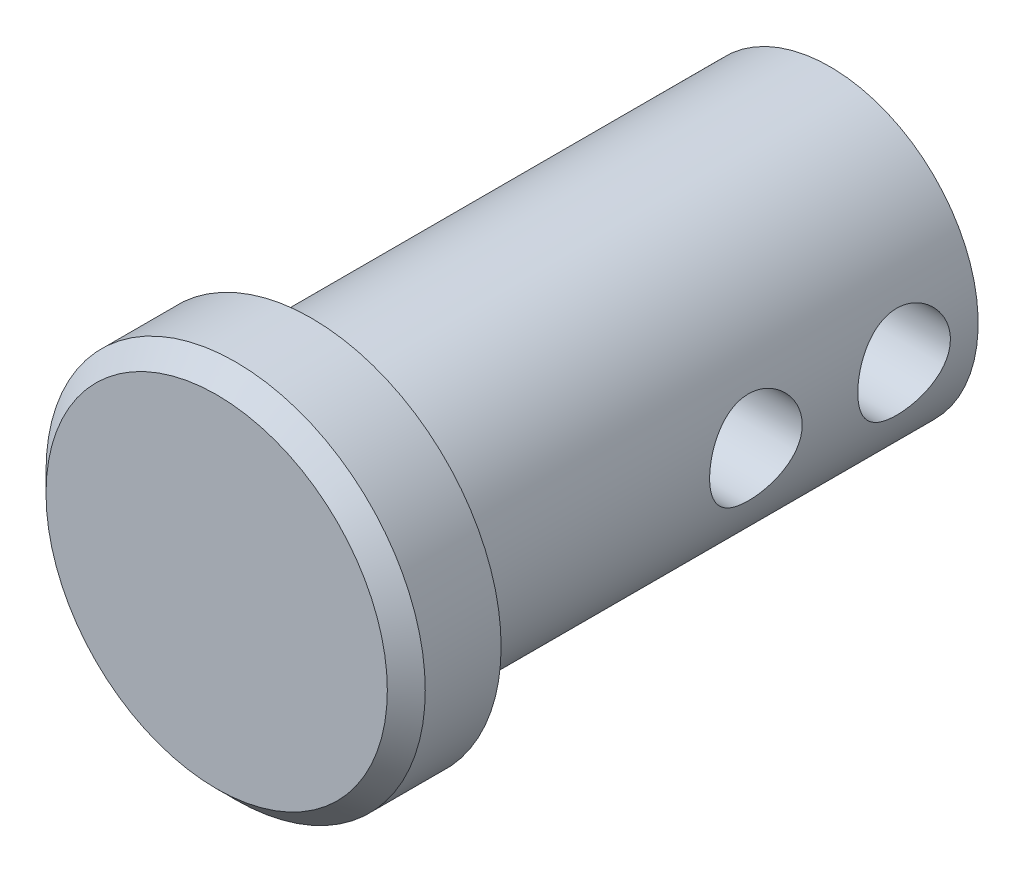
ISO-10303-21;
HEADER;
FILE_DESCRIPTION(('STEP AP214'),'2;1');
FILE_NAME('part.step','',(''),(''),'','','');
FILE_SCHEMA(('AUTOMOTIVE_DESIGN { 1 0 10303 214 1 1 1 1 }'));
ENDSEC;
DATA;
#1=APPLICATION_CONTEXT('core data for automotive mechanical design processes');
#2=APPLICATION_PROTOCOL_DEFINITION('international standard','automotive_design',2000,#1);
#3=PRODUCT_CONTEXT('',#1,'mechanical');
#4=PRODUCT('Part','Part','',(#3));
#5=PRODUCT_RELATED_PRODUCT_CATEGORY('part','',(#4));
#6=PRODUCT_DEFINITION_FORMATION('','',#4);
#7=PRODUCT_DEFINITION_CONTEXT('part definition',#1,'design');
#8=PRODUCT_DEFINITION('design','',#6,#7);
#9=PRODUCT_DEFINITION_SHAPE('','',#8);
#10=(LENGTH_UNIT() NAMED_UNIT(*) SI_UNIT(.MILLI.,.METRE.));
#11=(NAMED_UNIT(*) PLANE_ANGLE_UNIT() SI_UNIT($,.RADIAN.));
#12=(NAMED_UNIT(*) SI_UNIT($,.STERADIAN.) SOLID_ANGLE_UNIT());
#13=UNCERTAINTY_MEASURE_WITH_UNIT(LENGTH_MEASURE(1.E-05),#10,'distance_accuracy_value','');
#14=(GEOMETRIC_REPRESENTATION_CONTEXT(3) GLOBAL_UNCERTAINTY_ASSIGNED_CONTEXT((#13)) GLOBAL_UNIT_ASSIGNED_CONTEXT((#10,
#11,#12)) REPRESENTATION_CONTEXT('',''));
#15=CARTESIAN_POINT('',(0.,0.,0.));
#16=DIRECTION('',(0.,0.,1.));
#17=DIRECTION('',(1.,0.,0.));
#18=AXIS2_PLACEMENT_3D('',#15,#16,#17);
#19=CARTESIAN_POINT('',(0.,0.,25.4));
#20=DIRECTION('',(0.,0.,-1.));
#21=DIRECTION('',(-1.,0.,0.));
#22=AXIS2_PLACEMENT_3D('',#19,#20,#21);
#23=CYLINDRICAL_SURFACE('',#22,6.35);
#24=CARTESIAN_POINT('',(0.,0.,25.4));
#25=DIRECTION('',(0.,0.,1.));
#26=DIRECTION('',(1.,0.,0.));
#27=AXIS2_PLACEMENT_3D('',#24,#25,#26);
#28=CIRCLE('',#27,6.35);
#29=CARTESIAN_POINT('',(6.35,0.,25.4));
#30=VERTEX_POINT('',#29);
#31=EDGE_CURVE('E50',#30,#30,#28,.T.);
#32=ORIENTED_EDGE('',*,*,#31,.F.);
#33=EDGE_LOOP('',(#32));
#34=FACE_BOUND('',#33,.T.);
#35=CARTESIAN_POINT('',(6.35,0.,4.36562500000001));
#36=CARTESIAN_POINT('',(6.34999945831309,-0.108647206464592,4.36562570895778));
#37=CARTESIAN_POINT('',(6.34718528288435,-0.217301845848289,4.37457727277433));
#38=CARTESIAN_POINT('',(6.3362346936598,-0.431433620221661,4.41005315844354));
#39=CARTESIAN_POINT('',(6.32809707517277,-0.536910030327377,4.43658145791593));
#40=CARTESIAN_POINT('',(6.30738857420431,-0.741566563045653,4.50622887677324));
#41=CARTESIAN_POINT('',(6.29482455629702,-0.840756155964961,4.54932231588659));
#42=CARTESIAN_POINT('',(6.26656051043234,-1.030501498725,4.65076749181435));
#43=CARTESIAN_POINT('',(6.25085998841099,-1.12105588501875,4.70912163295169));
#44=CARTESIAN_POINT('',(6.21744714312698,-1.29375746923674,4.84132888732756));
#45=CARTESIAN_POINT('',(6.19969099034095,-1.37560054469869,4.91556815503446));
#46=CARTESIAN_POINT('',(6.16442198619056,-1.52590084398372,5.07661607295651));
#47=CARTESIAN_POINT('',(6.14690918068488,-1.59435557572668,5.1634270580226));
#48=CARTESIAN_POINT('',(6.11363942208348,-1.71758509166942,5.34978699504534));
#49=CARTESIAN_POINT('',(6.09793656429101,-1.77197994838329,5.44959774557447));
#50=CARTESIAN_POINT('',(6.07072385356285,-1.86308588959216,5.65752030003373));
#51=CARTESIAN_POINT('',(6.05921289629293,-1.89980163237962,5.76562990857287));
#52=CARTESIAN_POINT('',(6.04214576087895,-1.95339430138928,5.98364957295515));
#53=CARTESIAN_POINT('',(6.03642069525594,-1.97083537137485,6.09340736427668));
#54=CARTESIAN_POINT('',(6.03107212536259,-1.98714606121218,6.31442907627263));
#55=CARTESIAN_POINT('',(6.03144699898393,-1.98602061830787,6.42569258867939));
#56=CARTESIAN_POINT('',(6.03810687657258,-1.96567146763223,6.64190070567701));
#57=CARTESIAN_POINT('',(6.04415767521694,-1.94716491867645,6.74692123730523));
#58=CARTESIAN_POINT('',(6.06110715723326,-1.89374166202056,6.95228504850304));
#59=CARTESIAN_POINT('',(6.07200635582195,-1.85882321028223,7.05262782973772));
#60=CARTESIAN_POINT('',(6.09760407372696,-1.77306088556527,7.24749621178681));
#61=CARTESIAN_POINT('',(6.11235576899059,-1.72199181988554,7.34191541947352));
#62=CARTESIAN_POINT('',(6.14397197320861,-1.60553432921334,7.52107933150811));
#63=CARTESIAN_POINT('',(6.1608370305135,-1.54014218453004,7.60582151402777));
#64=CARTESIAN_POINT('',(6.19571925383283,-1.39337566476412,7.76728022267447));
#65=CARTESIAN_POINT('',(6.21375391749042,-1.31140925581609,7.84345579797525));
#66=CARTESIAN_POINT('',(6.24826618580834,-1.13564099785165,7.98111163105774));
#67=CARTESIAN_POINT('',(6.26474367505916,-1.04183827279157,8.04259080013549));
#68=CARTESIAN_POINT('',(6.29445805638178,-0.844017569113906,8.14947520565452));
#69=CARTESIAN_POINT('',(6.3076686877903,-0.739925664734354,8.19475141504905));
#70=CARTESIAN_POINT('',(6.3291712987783,-0.525094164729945,8.26699038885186));
#71=CARTESIAN_POINT('',(6.33746477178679,-0.414356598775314,8.29395871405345));
#72=CARTESIAN_POINT('',(6.34795830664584,-0.193968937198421,8.32789489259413));
#73=CARTESIAN_POINT('',(6.35038136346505,-0.0844420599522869,8.33559506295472));
#74=CARTESIAN_POINT('',(6.34952057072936,0.134350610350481,8.33284111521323));
#75=CARTESIAN_POINT('',(6.34623755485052,0.243616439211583,8.32238964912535));
#76=CARTESIAN_POINT('',(6.33448002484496,0.455960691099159,8.28421699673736));
#77=CARTESIAN_POINT('',(6.32613659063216,0.559125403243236,8.25693156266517));
#78=CARTESIAN_POINT('',(6.30523442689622,0.759383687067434,8.18639721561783));
#79=CARTESIAN_POINT('',(6.29267517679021,0.856476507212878,8.14314633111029));
#80=CARTESIAN_POINT('',(6.26425186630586,1.0444676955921,8.04073001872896));
#81=CARTESIAN_POINT('',(6.24831470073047,1.13515733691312,7.98120230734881));
#82=CARTESIAN_POINT('',(6.21495788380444,1.30550578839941,7.84835677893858));
#83=CARTESIAN_POINT('',(6.19753783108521,1.38516159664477,7.77503522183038));
#84=CARTESIAN_POINT('',(6.16230979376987,1.53445759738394,7.61323901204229));
#85=CARTESIAN_POINT('',(6.14451378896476,1.60357585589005,7.52427904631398));
#86=CARTESIAN_POINT('',(6.11127091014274,1.72594984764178,7.33563649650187));
#87=CARTESIAN_POINT('',(6.09582399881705,1.77920583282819,7.23595408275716));
#88=CARTESIAN_POINT('',(6.06919954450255,1.8680125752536,7.02890203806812));
#89=CARTESIAN_POINT('',(6.05800551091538,1.90363188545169,6.92156405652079));
#90=CARTESIAN_POINT('',(6.04124983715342,1.95616344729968,6.70199241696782));
#91=CARTESIAN_POINT('',(6.03568605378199,1.97308281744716,6.58976063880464));
#92=CARTESIAN_POINT('',(6.03104414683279,1.98722307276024,6.36904351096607));
#93=CARTESIAN_POINT('',(6.03168409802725,1.98530018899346,6.26061826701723));
#94=CARTESIAN_POINT('',(6.03869268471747,1.96387748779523,6.04571659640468));
#95=CARTESIAN_POINT('',(6.04506105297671,1.94437849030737,5.93924007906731));
#96=CARTESIAN_POINT('',(6.06261192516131,1.88893021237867,5.73278946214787));
#97=CARTESIAN_POINT('',(6.07372258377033,1.85322594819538,5.63274298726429));
#98=CARTESIAN_POINT('',(6.0994878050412,1.76657360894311,5.43998084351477));
#99=CARTESIAN_POINT('',(6.11414308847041,1.71562243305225,5.34726667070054));
#100=CARTESIAN_POINT('',(6.14606160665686,1.5975913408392,5.1678745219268));
#101=CARTESIAN_POINT('',(6.16340443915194,1.5299584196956,5.08157459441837));
#102=CARTESIAN_POINT('',(6.19837785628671,1.38145678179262,4.92127170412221));
#103=CARTESIAN_POINT('',(6.21600851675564,1.30058452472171,4.8472720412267));
#104=CARTESIAN_POINT('',(6.25026169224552,1.12472257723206,4.71125147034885));
#105=CARTESIAN_POINT('',(6.26683248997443,1.02935813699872,4.64970060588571));
#106=CARTESIAN_POINT('',(6.29644996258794,0.829118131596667,4.54358547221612));
#107=CARTESIAN_POINT('',(6.30949802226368,0.724246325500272,4.49901452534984));
#108=CARTESIAN_POINT('',(6.32969033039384,0.517124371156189,4.43136120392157));
#109=CARTESIAN_POINT('',(6.3372403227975,0.415401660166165,4.40678114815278));
#110=CARTESIAN_POINT('',(6.34739491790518,0.209121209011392,4.37391435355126));
#111=CARTESIAN_POINT('',(6.35000052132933,0.104564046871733,4.36562431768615));
#112=CARTESIAN_POINT('',(6.35,0.,4.36562500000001));
#113=B_SPLINE_CURVE_WITH_KNOTS('',3,(#35,#36,#37,#38,#39,#40,#41,#42,#43,#44,#45,#46,#47,#48,
#49,#50,#51,#52,#53,#54,#55,#56,#57,#58,#59,#60,#61,#62,#63,#64,#65,#66,#67,#68,#69,#70,#71,#72,
#73,#74,#75,#76,#77,#78,#79,#80,#81,#82,#83,#84,#85,#86,#87,#88,#89,#90,#91,#92,#93,#94,#95,#96,
#97,#98,#99,#100,#101,#102,#103,#104,#105,#106,#107,#108,#109,#110,#111,#112),.UNSPECIFIED.,.T.,
.F.,(4,2,2,2,2,2,2,2,2,2,2,2,2,2,2,2,2,2,2,2,2,2,2,2,2,2,2,2,2,2,2,2,2,2,2,2,2,2,4),(0.,
0.325557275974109,0.651188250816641,0.976316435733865,1.30149587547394,1.63572542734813,
1.9700171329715,2.31257111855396,2.65503479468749,2.98718525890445,3.31924739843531,
3.63818356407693,3.95715362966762,4.28078332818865,4.60449717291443,4.94294711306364,
5.28142211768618,5.62253543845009,5.96354510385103,6.29138265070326,6.61917230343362,
6.93881369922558,7.25849457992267,7.58596915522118,7.91353265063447,8.25407573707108,
8.59461341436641,8.9338168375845,9.27289109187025,9.59663123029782,9.92035626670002,
10.2393418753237,10.5583924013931,10.8899247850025,11.2215459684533,11.5639956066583,
11.9063104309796,12.2196961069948,12.5330183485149),.UNSPECIFIED.);
#114=CARTESIAN_POINT('',(6.35,0.,4.36562500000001));
#115=VERTEX_POINT('',#114);
#116=EDGE_CURVE('E54',#115,#115,#113,.T.);
#117=ORIENTED_EDGE('',*,*,#116,.T.);
#118=EDGE_LOOP('',(#117));
#119=FACE_BOUND('',#118,.T.);
#120=CARTESIAN_POINT('',(-6.35,0.,8.334375));
#121=CARTESIAN_POINT('',(-6.34999945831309,-0.108647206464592,8.33437429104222));
#122=CARTESIAN_POINT('',(-6.34718528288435,-0.217301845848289,8.32542272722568));
#123=CARTESIAN_POINT('',(-6.3362346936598,-0.431433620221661,8.28994684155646));
#124=CARTESIAN_POINT('',(-6.32809707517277,-0.536910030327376,8.26341854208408));
#125=CARTESIAN_POINT('',(-6.30738857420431,-0.741566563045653,8.19377112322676));
#126=CARTESIAN_POINT('',(-6.29482455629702,-0.840756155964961,8.15067768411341));
#127=CARTESIAN_POINT('',(-6.26656051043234,-1.030501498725,8.04923250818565));
#128=CARTESIAN_POINT('',(-6.25085998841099,-1.12105588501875,7.99087836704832));
#129=CARTESIAN_POINT('',(-6.21744714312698,-1.29375746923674,7.85867111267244));
#130=CARTESIAN_POINT('',(-6.19969099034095,-1.37560054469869,7.78443184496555));
#131=CARTESIAN_POINT('',(-6.16442198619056,-1.52590084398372,7.62338392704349));
#132=CARTESIAN_POINT('',(-6.14690918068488,-1.59435557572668,7.53657294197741));
#133=CARTESIAN_POINT('',(-6.11363942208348,-1.71758509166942,7.35021300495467));
#134=CARTESIAN_POINT('',(-6.09793656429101,-1.77197994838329,7.25040225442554));
#135=CARTESIAN_POINT('',(-6.07072385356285,-1.86308588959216,7.04247969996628));
#136=CARTESIAN_POINT('',(-6.05921289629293,-1.89980163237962,6.93437009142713));
#137=CARTESIAN_POINT('',(-6.04214576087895,-1.95339430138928,6.71635042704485));
#138=CARTESIAN_POINT('',(-6.03642069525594,-1.97083537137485,6.60659263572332));
#139=CARTESIAN_POINT('',(-6.03107212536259,-1.98714606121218,6.38557092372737));
#140=CARTESIAN_POINT('',(-6.03144699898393,-1.98602061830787,6.27430741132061));
#141=CARTESIAN_POINT('',(-6.03810687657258,-1.96567146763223,6.05809929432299));
#142=CARTESIAN_POINT('',(-6.04415767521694,-1.94716491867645,5.95307876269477));
#143=CARTESIAN_POINT('',(-6.06110715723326,-1.89374166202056,5.74771495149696));
#144=CARTESIAN_POINT('',(-6.07200635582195,-1.85882321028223,5.64737217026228));
#145=CARTESIAN_POINT('',(-6.09760407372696,-1.77306088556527,5.45250378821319));
#146=CARTESIAN_POINT('',(-6.11235576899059,-1.72199181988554,5.35808458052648));
#147=CARTESIAN_POINT('',(-6.14397197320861,-1.60553432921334,5.17892066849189));
#148=CARTESIAN_POINT('',(-6.1608370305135,-1.54014218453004,5.09417848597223));
#149=CARTESIAN_POINT('',(-6.19571925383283,-1.39337566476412,4.93271977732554));
#150=CARTESIAN_POINT('',(-6.21375391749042,-1.31140925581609,4.85654420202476));
#151=CARTESIAN_POINT('',(-6.24826618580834,-1.13564099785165,4.71888836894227));
#152=CARTESIAN_POINT('',(-6.26474367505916,-1.04183827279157,4.65740919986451));
#153=CARTESIAN_POINT('',(-6.29445805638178,-0.844017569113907,4.55052479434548));
#154=CARTESIAN_POINT('',(-6.3076686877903,-0.739925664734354,4.50524858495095));
#155=CARTESIAN_POINT('',(-6.3291712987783,-0.525094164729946,4.43300961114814));
#156=CARTESIAN_POINT('',(-6.33746477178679,-0.414356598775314,4.40604128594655));
#157=CARTESIAN_POINT('',(-6.34795830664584,-0.193968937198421,4.37210510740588));
#158=CARTESIAN_POINT('',(-6.35038136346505,-0.084442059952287,4.36440493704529));
#159=CARTESIAN_POINT('',(-6.34952057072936,0.13435061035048,4.36715888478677));
#160=CARTESIAN_POINT('',(-6.34623755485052,0.243616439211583,4.37761035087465));
#161=CARTESIAN_POINT('',(-6.33448002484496,0.455960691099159,4.41578300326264));
#162=CARTESIAN_POINT('',(-6.32613659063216,0.559125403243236,4.44306843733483));
#163=CARTESIAN_POINT('',(-6.30523442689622,0.759383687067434,4.51360278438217));
#164=CARTESIAN_POINT('',(-6.29267517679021,0.856476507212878,4.55685366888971));
#165=CARTESIAN_POINT('',(-6.26425186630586,1.0444676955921,4.65926998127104));
#166=CARTESIAN_POINT('',(-6.24831470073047,1.13515733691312,4.71879769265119));
#167=CARTESIAN_POINT('',(-6.21495788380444,1.30550578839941,4.85164322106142));
#168=CARTESIAN_POINT('',(-6.19753783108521,1.38516159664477,4.92496477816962));
#169=CARTESIAN_POINT('',(-6.16230979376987,1.53445759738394,5.08676098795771));
#170=CARTESIAN_POINT('',(-6.14451378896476,1.60357585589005,5.17572095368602));
#171=CARTESIAN_POINT('',(-6.11127091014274,1.72594984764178,5.36436350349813));
#172=CARTESIAN_POINT('',(-6.09582399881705,1.77920583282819,5.46404591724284));
#173=CARTESIAN_POINT('',(-6.06919954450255,1.8680125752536,5.67109796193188));
#174=CARTESIAN_POINT('',(-6.05800551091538,1.90363188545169,5.77843594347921));
#175=CARTESIAN_POINT('',(-6.04124983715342,1.95616344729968,5.99800758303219));
#176=CARTESIAN_POINT('',(-6.03568605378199,1.97308281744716,6.11023936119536));
#177=CARTESIAN_POINT('',(-6.03104414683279,1.98722307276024,6.33095648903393));
#178=CARTESIAN_POINT('',(-6.03168409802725,1.98530018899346,6.43938173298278));
#179=CARTESIAN_POINT('',(-6.03869268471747,1.96387748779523,6.65428340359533));
#180=CARTESIAN_POINT('',(-6.04506105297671,1.94437849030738,6.76075992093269));
#181=CARTESIAN_POINT('',(-6.06261192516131,1.88893021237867,6.96721053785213));
#182=CARTESIAN_POINT('',(-6.07372258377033,1.85322594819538,7.06725701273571));
#183=CARTESIAN_POINT('',(-6.0994878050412,1.76657360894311,7.26001915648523));
#184=CARTESIAN_POINT('',(-6.11414308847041,1.71562243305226,7.35273332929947));
#185=CARTESIAN_POINT('',(-6.14606160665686,1.5975913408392,7.5321254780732));
#186=CARTESIAN_POINT('',(-6.16340443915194,1.5299584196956,7.61842540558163));
#187=CARTESIAN_POINT('',(-6.19837785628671,1.38145678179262,7.7787282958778));
#188=CARTESIAN_POINT('',(-6.21600851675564,1.30058452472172,7.8527279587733));
#189=CARTESIAN_POINT('',(-6.25026169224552,1.12472257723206,7.98874852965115));
#190=CARTESIAN_POINT('',(-6.26683248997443,1.02935813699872,8.05029939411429));
#191=CARTESIAN_POINT('',(-6.29644996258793,0.829118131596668,8.15641452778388));
#192=CARTESIAN_POINT('',(-6.30949802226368,0.724246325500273,8.20098547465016));
#193=CARTESIAN_POINT('',(-6.32969033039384,0.51712437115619,8.26863879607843));
#194=CARTESIAN_POINT('',(-6.3372403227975,0.415401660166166,8.29321885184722));
#195=CARTESIAN_POINT('',(-6.34739491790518,0.209121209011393,8.32608564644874));
#196=CARTESIAN_POINT('',(-6.35000052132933,0.104564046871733,8.33437568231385));
#197=CARTESIAN_POINT('',(-6.35,0.,8.334375));
#198=B_SPLINE_CURVE_WITH_KNOTS('',3,(#120,#121,#122,#123,#124,#125,#126,#127,#128,#129,#130,
#131,#132,#133,#134,#135,#136,#137,#138,#139,#140,#141,#142,#143,#144,#145,#146,#147,#148,#149,
#150,#151,#152,#153,#154,#155,#156,#157,#158,#159,#160,#161,#162,#163,#164,#165,#166,#167,#168,
#169,#170,#171,#172,#173,#174,#175,#176,#177,#178,#179,#180,#181,#182,#183,#184,#185,#186,#187,
#188,#189,#190,#191,#192,#193,#194,#195,#196,#197),.UNSPECIFIED.,.T.,.F.,(4,2,2,2,2,2,2,2,2,2,2,
2,2,2,2,2,2,2,2,2,2,2,2,2,2,2,2,2,2,2,2,2,2,2,2,2,2,2,4),(0.,0.325557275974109,
0.651188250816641,0.976316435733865,1.30149587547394,1.63572542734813,1.9700171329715,
2.31257111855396,2.65503479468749,2.98718525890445,3.31924739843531,3.63818356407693,
3.95715362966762,4.28078332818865,4.60449717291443,4.94294711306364,5.28142211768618,
5.62253543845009,5.96354510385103,6.29138265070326,6.61917230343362,6.93881369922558,
7.25849457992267,7.58596915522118,7.91353265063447,8.25407573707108,8.59461341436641,
8.9338168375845,9.27289109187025,9.59663123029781,9.92035626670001,10.2393418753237,
10.5583924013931,10.8899247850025,11.2215459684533,11.5639956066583,11.9063104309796,
12.2196961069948,12.5330183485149),.UNSPECIFIED.);
#199=CARTESIAN_POINT('',(-6.35,0.,8.334375));
#200=VERTEX_POINT('',#199);
#201=EDGE_CURVE('E60',#200,#200,#198,.T.);
#202=ORIENTED_EDGE('',*,*,#201,.T.);
#203=EDGE_LOOP('',(#202));
#204=FACE_BOUND('',#203,.T.);
#205=CARTESIAN_POINT('',(6.35,0.,10.715625));
#206=CARTESIAN_POINT('',(6.34999945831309,-0.108647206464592,10.7156257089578));
#207=CARTESIAN_POINT('',(6.34718528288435,-0.217301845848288,10.7245772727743));
#208=CARTESIAN_POINT('',(6.3362346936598,-0.431433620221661,10.7600531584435));
#209=CARTESIAN_POINT('',(6.32809707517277,-0.536910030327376,10.7865814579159));
#210=CARTESIAN_POINT('',(6.30738857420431,-0.741566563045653,10.8562288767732));
#211=CARTESIAN_POINT('',(6.29482455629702,-0.840756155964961,10.8993223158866));
#212=CARTESIAN_POINT('',(6.26656051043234,-1.030501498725,11.0007674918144));
#213=CARTESIAN_POINT('',(6.25085998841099,-1.12105588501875,11.0591216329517));
#214=CARTESIAN_POINT('',(6.21744714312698,-1.29375746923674,11.1913288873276));
#215=CARTESIAN_POINT('',(6.19969099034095,-1.37560054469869,11.2655681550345));
#216=CARTESIAN_POINT('',(6.16442198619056,-1.52590084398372,11.4266160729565));
#217=CARTESIAN_POINT('',(6.14690918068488,-1.59435557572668,11.5134270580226));
#218=CARTESIAN_POINT('',(6.11363942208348,-1.71758509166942,11.6997869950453));
#219=CARTESIAN_POINT('',(6.09793656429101,-1.77197994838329,11.7995977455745));
#220=CARTESIAN_POINT('',(6.07072385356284,-1.86308588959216,12.0075203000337));
#221=CARTESIAN_POINT('',(6.05921289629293,-1.89980163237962,12.1156299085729));
#222=CARTESIAN_POINT('',(6.04214576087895,-1.95339430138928,12.3336495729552));
#223=CARTESIAN_POINT('',(6.03642069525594,-1.97083537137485,12.4434073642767));
#224=CARTESIAN_POINT('',(6.03107212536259,-1.98714606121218,12.6644290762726));
#225=CARTESIAN_POINT('',(6.03144699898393,-1.98602061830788,12.7756925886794));
#226=CARTESIAN_POINT('',(6.03810687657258,-1.96567146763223,12.991900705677));
#227=CARTESIAN_POINT('',(6.04415767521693,-1.94716491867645,13.0969212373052));
#228=CARTESIAN_POINT('',(6.06110715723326,-1.89374166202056,13.302285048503));
#229=CARTESIAN_POINT('',(6.07200635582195,-1.85882321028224,13.4026278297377));
#230=CARTESIAN_POINT('',(6.09760407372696,-1.77306088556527,13.5974962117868));
#231=CARTESIAN_POINT('',(6.11235576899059,-1.72199181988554,13.6919154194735));
#232=CARTESIAN_POINT('',(6.14397197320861,-1.60553432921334,13.8710793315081));
#233=CARTESIAN_POINT('',(6.1608370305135,-1.54014218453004,13.9558215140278));
#234=CARTESIAN_POINT('',(6.19571925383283,-1.39337566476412,14.1172802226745));
#235=CARTESIAN_POINT('',(6.21375391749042,-1.31140925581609,14.1934557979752));
#236=CARTESIAN_POINT('',(6.24826618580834,-1.13564099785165,14.3311116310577));
#237=CARTESIAN_POINT('',(6.26474367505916,-1.04183827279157,14.3925908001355));
#238=CARTESIAN_POINT('',(6.29445805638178,-0.844017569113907,14.4994752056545));
#239=CARTESIAN_POINT('',(6.3076686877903,-0.739925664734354,14.5447514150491));
#240=CARTESIAN_POINT('',(6.3291712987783,-0.525094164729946,14.6169903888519));
#241=CARTESIAN_POINT('',(6.33746477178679,-0.414356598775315,14.6439587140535));
#242=CARTESIAN_POINT('',(6.34795830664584,-0.193968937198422,14.6778948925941));
#243=CARTESIAN_POINT('',(6.35038136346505,-0.0844420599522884,14.6855950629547));
#244=CARTESIAN_POINT('',(6.34952057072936,0.134350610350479,14.6828411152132));
#245=CARTESIAN_POINT('',(6.34623755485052,0.243616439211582,14.6723896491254));
#246=CARTESIAN_POINT('',(6.33448002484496,0.455960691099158,14.6342169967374));
#247=CARTESIAN_POINT('',(6.32613659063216,0.559125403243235,14.6069315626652));
#248=CARTESIAN_POINT('',(6.30523442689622,0.759383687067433,14.5363972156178));
#249=CARTESIAN_POINT('',(6.29267517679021,0.856476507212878,14.4931463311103));
#250=CARTESIAN_POINT('',(6.26425186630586,1.0444676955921,14.390730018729));
#251=CARTESIAN_POINT('',(6.24831470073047,1.13515733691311,14.3312023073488));
#252=CARTESIAN_POINT('',(6.21495788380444,1.30550578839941,14.1983567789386));
#253=CARTESIAN_POINT('',(6.19753783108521,1.38516159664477,14.1250352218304));
#254=CARTESIAN_POINT('',(6.16230979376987,1.53445759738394,13.9632390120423));
#255=CARTESIAN_POINT('',(6.14451378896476,1.60357585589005,13.874279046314));
#256=CARTESIAN_POINT('',(6.11127091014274,1.72594984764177,13.6856364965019));
#257=CARTESIAN_POINT('',(6.09582399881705,1.77920583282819,13.5859540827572));
#258=CARTESIAN_POINT('',(6.06919954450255,1.8680125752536,13.3789020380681));
#259=CARTESIAN_POINT('',(6.05800551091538,1.90363188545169,13.2715640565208));
#260=CARTESIAN_POINT('',(6.04124983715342,1.95616344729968,13.0519924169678));
#261=CARTESIAN_POINT('',(6.03568605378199,1.97308281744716,12.9397606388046));
#262=CARTESIAN_POINT('',(6.03104414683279,1.98722307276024,12.7190435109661));
#263=CARTESIAN_POINT('',(6.03168409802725,1.98530018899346,12.6106182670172));
#264=CARTESIAN_POINT('',(6.03869268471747,1.96387748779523,12.3957165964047));
#265=CARTESIAN_POINT('',(6.04506105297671,1.94437849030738,12.2892400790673));
#266=CARTESIAN_POINT('',(6.06261192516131,1.88893021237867,12.0827894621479));
#267=CARTESIAN_POINT('',(6.07372258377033,1.85322594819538,11.9827429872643));
#268=CARTESIAN_POINT('',(6.0994878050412,1.76657360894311,11.7899808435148));
#269=CARTESIAN_POINT('',(6.11414308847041,1.71562243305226,11.6972666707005));
#270=CARTESIAN_POINT('',(6.14606160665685,1.5975913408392,11.5178745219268));
#271=CARTESIAN_POINT('',(6.16340443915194,1.5299584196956,11.4315745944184));
#272=CARTESIAN_POINT('',(6.19837785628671,1.38145678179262,11.2712717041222));
#273=CARTESIAN_POINT('',(6.21600851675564,1.30058452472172,11.1972720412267));
#274=CARTESIAN_POINT('',(6.25026169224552,1.12472257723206,11.0612514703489));
#275=CARTESIAN_POINT('',(6.26683248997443,1.02935813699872,10.9997006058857));
#276=CARTESIAN_POINT('',(6.29644996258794,0.829118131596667,10.8935854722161));
#277=CARTESIAN_POINT('',(6.30949802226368,0.724246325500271,10.8490145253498));
#278=CARTESIAN_POINT('',(6.32969033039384,0.517124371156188,10.7813612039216));
#279=CARTESIAN_POINT('',(6.3372403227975,0.415401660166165,10.7567811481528));
#280=CARTESIAN_POINT('',(6.34739491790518,0.209121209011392,10.7239143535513));
#281=CARTESIAN_POINT('',(6.35000052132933,0.104564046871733,10.7156243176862));
#282=CARTESIAN_POINT('',(6.35,0.,10.715625));
#283=B_SPLINE_CURVE_WITH_KNOTS('',3,(#205,#206,#207,#208,#209,#210,#211,#212,#213,#214,#215,
#216,#217,#218,#219,#220,#221,#222,#223,#224,#225,#226,#227,#228,#229,#230,#231,#232,#233,#234,
#235,#236,#237,#238,#239,#240,#241,#242,#243,#244,#245,#246,#247,#248,#249,#250,#251,#252,#253,
#254,#255,#256,#257,#258,#259,#260,#261,#262,#263,#264,#265,#266,#267,#268,#269,#270,#271,#272,
#273,#274,#275,#276,#277,#278,#279,#280,#281,#282),.UNSPECIFIED.,.T.,.F.,(4,2,2,2,2,2,2,2,2,2,2,
2,2,2,2,2,2,2,2,2,2,2,2,2,2,2,2,2,2,2,2,2,2,2,2,2,2,2,4),(0.,0.325557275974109,
0.651188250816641,0.976316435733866,1.30149587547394,1.63572542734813,1.9700171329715,
2.31257111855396,2.65503479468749,2.98718525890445,3.31924739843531,3.63818356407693,
3.95715362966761,4.28078332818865,4.60449717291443,4.94294711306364,5.28142211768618,
5.62253543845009,5.96354510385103,6.29138265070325,6.61917230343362,6.93881369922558,
7.25849457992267,7.58596915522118,7.91353265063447,8.25407573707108,8.59461341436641,
8.93381683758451,9.27289109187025,9.59663123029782,9.92035626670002,10.2393418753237,
10.5583924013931,10.8899247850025,11.2215459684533,11.5639956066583,11.9063104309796,
12.2196961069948,12.5330183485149),.UNSPECIFIED.);
#284=CARTESIAN_POINT('',(6.35,0.,10.715625));
#285=VERTEX_POINT('',#284);
#286=EDGE_CURVE('E104',#285,#285,#283,.T.);
#287=ORIENTED_EDGE('',*,*,#286,.T.);
#288=EDGE_LOOP('',(#287));
#289=FACE_BOUND('',#288,.T.);
#290=CARTESIAN_POINT('',(-6.35,0.,14.684375));
#291=CARTESIAN_POINT('',(-6.34999945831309,-0.108647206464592,14.6843742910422));
#292=CARTESIAN_POINT('',(-6.34718528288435,-0.217301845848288,14.6754227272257));
#293=CARTESIAN_POINT('',(-6.3362346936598,-0.431433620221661,14.6399468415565));
#294=CARTESIAN_POINT('',(-6.32809707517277,-0.536910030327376,14.6134185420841));
#295=CARTESIAN_POINT('',(-6.30738857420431,-0.741566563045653,14.5437711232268));
#296=CARTESIAN_POINT('',(-6.29482455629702,-0.840756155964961,14.5006776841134));
#297=CARTESIAN_POINT('',(-6.26656051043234,-1.030501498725,14.3992325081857));
#298=CARTESIAN_POINT('',(-6.25085998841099,-1.12105588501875,14.3408783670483));
#299=CARTESIAN_POINT('',(-6.21744714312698,-1.29375746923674,14.2086711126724));
#300=CARTESIAN_POINT('',(-6.19969099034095,-1.37560054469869,14.1344318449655));
#301=CARTESIAN_POINT('',(-6.16442198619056,-1.52590084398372,13.9733839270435));
#302=CARTESIAN_POINT('',(-6.14690918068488,-1.59435557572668,13.8865729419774));
#303=CARTESIAN_POINT('',(-6.11363942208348,-1.71758509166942,13.7002130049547));
#304=CARTESIAN_POINT('',(-6.09793656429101,-1.77197994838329,13.6004022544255));
#305=CARTESIAN_POINT('',(-6.07072385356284,-1.86308588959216,13.3924796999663));
#306=CARTESIAN_POINT('',(-6.05921289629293,-1.89980163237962,13.2843700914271));
#307=CARTESIAN_POINT('',(-6.04214576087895,-1.95339430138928,13.0663504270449));
#308=CARTESIAN_POINT('',(-6.03642069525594,-1.97083537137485,12.9565926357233));
#309=CARTESIAN_POINT('',(-6.03107212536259,-1.98714606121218,12.7355709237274));
#310=CARTESIAN_POINT('',(-6.03144699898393,-1.98602061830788,12.6243074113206));
#311=CARTESIAN_POINT('',(-6.03810687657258,-1.96567146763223,12.408099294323));
#312=CARTESIAN_POINT('',(-6.04415767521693,-1.94716491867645,12.3030787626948));
#313=CARTESIAN_POINT('',(-6.06110715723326,-1.89374166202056,12.097714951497));
#314=CARTESIAN_POINT('',(-6.07200635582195,-1.85882321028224,11.9973721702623));
#315=CARTESIAN_POINT('',(-6.09760407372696,-1.77306088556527,11.8025037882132));
#316=CARTESIAN_POINT('',(-6.11235576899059,-1.72199181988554,11.7080845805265));
#317=CARTESIAN_POINT('',(-6.14397197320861,-1.60553432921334,11.5289206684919));
#318=CARTESIAN_POINT('',(-6.1608370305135,-1.54014218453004,11.4441784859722));
#319=CARTESIAN_POINT('',(-6.19571925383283,-1.39337566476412,11.2827197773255));
#320=CARTESIAN_POINT('',(-6.21375391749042,-1.31140925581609,11.2065442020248));
#321=CARTESIAN_POINT('',(-6.24826618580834,-1.13564099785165,11.0688883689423));
#322=CARTESIAN_POINT('',(-6.26474367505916,-1.04183827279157,11.0074091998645));
#323=CARTESIAN_POINT('',(-6.29445805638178,-0.844017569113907,10.9005247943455));
#324=CARTESIAN_POINT('',(-6.3076686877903,-0.739925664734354,10.855248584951));
#325=CARTESIAN_POINT('',(-6.3291712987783,-0.525094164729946,10.7830096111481));
#326=CARTESIAN_POINT('',(-6.33746477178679,-0.414356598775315,10.7560412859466));
#327=CARTESIAN_POINT('',(-6.34795830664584,-0.193968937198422,10.7221051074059));
#328=CARTESIAN_POINT('',(-6.35038136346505,-0.0844420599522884,10.7144049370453));
#329=CARTESIAN_POINT('',(-6.34952057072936,0.134350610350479,10.7171588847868));
#330=CARTESIAN_POINT('',(-6.34623755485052,0.243616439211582,10.7276103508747));
#331=CARTESIAN_POINT('',(-6.33448002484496,0.455960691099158,10.7657830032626));
#332=CARTESIAN_POINT('',(-6.32613659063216,0.559125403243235,10.7930684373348));
#333=CARTESIAN_POINT('',(-6.30523442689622,0.759383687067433,10.8636027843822));
#334=CARTESIAN_POINT('',(-6.29267517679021,0.856476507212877,10.9068536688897));
#335=CARTESIAN_POINT('',(-6.26425186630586,1.0444676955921,11.009269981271));
#336=CARTESIAN_POINT('',(-6.24831470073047,1.13515733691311,11.0687976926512));
#337=CARTESIAN_POINT('',(-6.21495788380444,1.30550578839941,11.2016432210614));
#338=CARTESIAN_POINT('',(-6.19753783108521,1.38516159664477,11.2749647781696));
#339=CARTESIAN_POINT('',(-6.16230979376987,1.53445759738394,11.4367609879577));
#340=CARTESIAN_POINT('',(-6.14451378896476,1.60357585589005,11.525720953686));
#341=CARTESIAN_POINT('',(-6.11127091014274,1.72594984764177,11.7143635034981));
#342=CARTESIAN_POINT('',(-6.09582399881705,1.77920583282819,11.8140459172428));
#343=CARTESIAN_POINT('',(-6.06919954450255,1.8680125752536,12.0210979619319));
#344=CARTESIAN_POINT('',(-6.05800551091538,1.90363188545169,12.1284359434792));
#345=CARTESIAN_POINT('',(-6.04124983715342,1.95616344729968,12.3480075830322));
#346=CARTESIAN_POINT('',(-6.03568605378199,1.97308281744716,12.4602393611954));
#347=CARTESIAN_POINT('',(-6.03104414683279,1.98722307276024,12.6809564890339));
#348=CARTESIAN_POINT('',(-6.03168409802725,1.98530018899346,12.7893817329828));
#349=CARTESIAN_POINT('',(-6.03869268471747,1.96387748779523,13.0042834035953));
#350=CARTESIAN_POINT('',(-6.04506105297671,1.94437849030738,13.1107599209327));
#351=CARTESIAN_POINT('',(-6.06261192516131,1.88893021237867,13.3172105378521));
#352=CARTESIAN_POINT('',(-6.07372258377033,1.85322594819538,13.4172570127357));
#353=CARTESIAN_POINT('',(-6.0994878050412,1.76657360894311,13.6100191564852));
#354=CARTESIAN_POINT('',(-6.11414308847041,1.71562243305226,13.7027333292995));
#355=CARTESIAN_POINT('',(-6.14606160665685,1.5975913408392,13.8821254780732));
#356=CARTESIAN_POINT('',(-6.16340443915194,1.5299584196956,13.9684254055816));
#357=CARTESIAN_POINT('',(-6.19837785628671,1.38145678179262,14.1287282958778));
#358=CARTESIAN_POINT('',(-6.21600851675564,1.30058452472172,14.2027279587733));
#359=CARTESIAN_POINT('',(-6.25026169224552,1.12472257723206,14.3387485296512));
#360=CARTESIAN_POINT('',(-6.26683248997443,1.02935813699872,14.4002993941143));
#361=CARTESIAN_POINT('',(-6.29644996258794,0.829118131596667,14.5064145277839));
#362=CARTESIAN_POINT('',(-6.30949802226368,0.724246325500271,14.5509854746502));
#363=CARTESIAN_POINT('',(-6.32969033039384,0.517124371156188,14.6186387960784));
#364=CARTESIAN_POINT('',(-6.3372403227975,0.415401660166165,14.6432188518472));
#365=CARTESIAN_POINT('',(-6.34739491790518,0.209121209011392,14.6760856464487));
#366=CARTESIAN_POINT('',(-6.35000052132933,0.104564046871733,14.6843756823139));
#367=CARTESIAN_POINT('',(-6.35,0.,14.684375));
#368=B_SPLINE_CURVE_WITH_KNOTS('',3,(#290,#291,#292,#293,#294,#295,#296,#297,#298,#299,#300,
#301,#302,#303,#304,#305,#306,#307,#308,#309,#310,#311,#312,#313,#314,#315,#316,#317,#318,#319,
#320,#321,#322,#323,#324,#325,#326,#327,#328,#329,#330,#331,#332,#333,#334,#335,#336,#337,#338,
#339,#340,#341,#342,#343,#344,#345,#346,#347,#348,#349,#350,#351,#352,#353,#354,#355,#356,#357,
#358,#359,#360,#361,#362,#363,#364,#365,#366,#367),.UNSPECIFIED.,.T.,.F.,(4,2,2,2,2,2,2,2,2,2,2,
2,2,2,2,2,2,2,2,2,2,2,2,2,2,2,2,2,2,2,2,2,2,2,2,2,2,2,4),(0.,0.325557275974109,
0.651188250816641,0.976316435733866,1.30149587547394,1.63572542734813,1.9700171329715,
2.31257111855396,2.65503479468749,2.98718525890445,3.31924739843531,3.63818356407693,
3.95715362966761,4.28078332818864,4.60449717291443,4.94294711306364,5.28142211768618,
5.62253543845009,5.96354510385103,6.29138265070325,6.61917230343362,6.93881369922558,
7.25849457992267,7.58596915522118,7.91353265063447,8.25407573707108,8.59461341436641,
8.93381683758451,9.27289109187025,9.59663123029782,9.92035626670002,10.2393418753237,
10.5583924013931,10.8899247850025,11.2215459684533,11.5639956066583,11.9063104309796,
12.2196961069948,12.5330183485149),.UNSPECIFIED.);
#369=CARTESIAN_POINT('',(-6.35,0.,14.684375));
#370=VERTEX_POINT('',#369);
#371=EDGE_CURVE('E61',#370,#370,#368,.T.);
#372=ORIENTED_EDGE('',*,*,#371,.T.);
#373=EDGE_LOOP('',(#372));
#374=FACE_BOUND('',#373,.T.);
#375=CARTESIAN_POINT('',(0.,0.,3.175));
#376=DIRECTION('',(0.,0.,-1.));
#377=DIRECTION('',(-1.,0.,0.));
#378=AXIS2_PLACEMENT_3D('',#375,#376,#377);
#379=CIRCLE('',#378,6.35);
#380=CARTESIAN_POINT('',(-6.35,0.,3.175));
#381=VERTEX_POINT('',#380);
#382=EDGE_CURVE('E10',#381,#381,#379,.T.);
#383=ORIENTED_EDGE('',*,*,#382,.F.);
#384=EDGE_LOOP('',(#383));
#385=FACE_BOUND('',#384,.T.);
#386=ADVANCED_FACE('F34',(#34,#119,#204,#289,#374,#385),#23,.T.);
#387=CARTESIAN_POINT('',(0.,0.,25.4));
#388=DIRECTION('',(0.,0.,1.));
#389=DIRECTION('',(1.,0.,0.));
#390=AXIS2_PLACEMENT_3D('',#387,#388,#389);
#391=PLANE('',#390);
#392=CARTESIAN_POINT('',(0.,0.,25.4));
#393=DIRECTION('',(0.,0.,1.));
#394=DIRECTION('',(1.,0.,0.));
#395=AXIS2_PLACEMENT_3D('',#392,#393,#394);
#396=CIRCLE('',#395,8.128);
#397=CARTESIAN_POINT('',(8.128,0.,25.4));
#398=VERTEX_POINT('',#397);
#399=EDGE_CURVE('E170',#398,#398,#396,.T.);
#400=ORIENTED_EDGE('',*,*,#399,.F.);
#401=EDGE_LOOP('',(#400));
#402=FACE_BOUND('',#401,.T.);
#403=ORIENTED_EDGE('',*,*,#31,.T.);
#404=EDGE_LOOP('',(#403));
#405=FACE_BOUND('',#404,.T.);
#406=ADVANCED_FACE('F82',(#402,#405),#391,.F.);
#407=CARTESIAN_POINT('',(0.,0.,29.464));
#408=DIRECTION('',(0.,0.,-1.));
#409=DIRECTION('',(-1.,0.,0.));
#410=AXIS2_PLACEMENT_3D('',#407,#408,#409);
#411=CYLINDRICAL_SURFACE('',#410,8.128);
#412=CARTESIAN_POINT('',(0.,0.,28.6512));
#413=DIRECTION('',(0.,0.,1.));
#414=DIRECTION('',(1.,0.,0.));
#415=AXIS2_PLACEMENT_3D('',#412,#413,#414);
#416=CIRCLE('',#415,8.128);
#417=CARTESIAN_POINT('',(-8.128,0.,28.6512));
#418=VERTEX_POINT('',#417);
#419=EDGE_CURVE('E41',#418,#418,#416,.F.);
#420=ORIENTED_EDGE('',*,*,#419,.T.);
#421=EDGE_LOOP('',(#420));
#422=FACE_BOUND('',#421,.T.);
#423=ORIENTED_EDGE('',*,*,#399,.T.);
#424=EDGE_LOOP('',(#423));
#425=FACE_BOUND('',#424,.T.);
#426=ADVANCED_FACE('F80',(#422,#425),#411,.T.);
#427=CARTESIAN_POINT('',(0.,0.,29.464));
#428=DIRECTION('',(0.,0.,1.));
#429=DIRECTION('',(1.,0.,0.));
#430=AXIS2_PLACEMENT_3D('',#427,#428,#429);
#431=PLANE('',#430);
#432=CARTESIAN_POINT('',(0.,0.,29.464));
#433=DIRECTION('',(0.,0.,1.));
#434=DIRECTION('',(1.,0.,0.));
#435=AXIS2_PLACEMENT_3D('',#432,#433,#434);
#436=CIRCLE('',#435,7.3152);
#437=CARTESIAN_POINT('',(-7.3152,0.,29.464));
#438=VERTEX_POINT('',#437);
#439=EDGE_CURVE('E45',#438,#438,#436,.T.);
#440=ORIENTED_EDGE('',*,*,#439,.T.);
#441=EDGE_LOOP('',(#440));
#442=FACE_BOUND('',#441,.T.);
#443=ADVANCED_FACE('F76',(#442),#431,.T.);
#444=CARTESIAN_POINT('',(0.,0.,29.464));
#445=DIRECTION('',(0.,0.,-1.));
#446=DIRECTION('',(-1.,0.,0.));
#447=AXIS2_PLACEMENT_3D('',#444,#445,#446);
#448=CONICAL_SURFACE('',#447,7.3152,0.785398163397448);
#449=CARTESIAN_POINT('',(-8.128,0.,28.6512));
#450=CARTESIAN_POINT('',(-8.11953333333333,0.,28.6596666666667));
#451=CARTESIAN_POINT('',(-8.11106666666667,0.,28.6681333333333));
#452=CARTESIAN_POINT('',(-8.09413333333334,0.,28.6850666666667));
#453=CARTESIAN_POINT('',(-8.08566666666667,0.,28.6935333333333));
#454=CARTESIAN_POINT('',(-8.06873333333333,0.,28.7104666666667));
#455=CARTESIAN_POINT('',(-8.06026666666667,0.,28.7189333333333));
#456=CARTESIAN_POINT('',(-8.04333333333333,0.,28.7358666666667));
#457=CARTESIAN_POINT('',(-8.03486666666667,0.,28.7443333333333));
#458=CARTESIAN_POINT('',(-8.01793333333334,0.,28.7612666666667));
#459=CARTESIAN_POINT('',(-8.00946666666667,0.,28.7697333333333));
#460=CARTESIAN_POINT('',(-7.99253333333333,0.,28.7866666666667));
#461=CARTESIAN_POINT('',(-7.98406666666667,0.,28.7951333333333));
#462=CARTESIAN_POINT('',(-7.96713333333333,0.,28.8120666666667));
#463=CARTESIAN_POINT('',(-7.95866666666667,0.,28.8205333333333));
#464=CARTESIAN_POINT('',(-7.94173333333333,0.,28.8374666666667));
#465=CARTESIAN_POINT('',(-7.93326666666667,0.,28.8459333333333));
#466=CARTESIAN_POINT('',(-7.91633333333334,0.,28.8628666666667));
#467=CARTESIAN_POINT('',(-7.90786666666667,0.,28.8713333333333));
#468=CARTESIAN_POINT('',(-7.89093333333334,0.,28.8882666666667));
#469=CARTESIAN_POINT('',(-7.88246666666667,0.,28.8967333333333));
#470=CARTESIAN_POINT('',(-7.86553333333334,0.,28.9136666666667));
#471=CARTESIAN_POINT('',(-7.85706666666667,0.,28.9221333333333));
#472=CARTESIAN_POINT('',(-7.84013333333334,0.,28.9390666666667));
#473=CARTESIAN_POINT('',(-7.83166666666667,0.,28.9475333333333));
#474=CARTESIAN_POINT('',(-7.81473333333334,0.,28.9644666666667));
#475=CARTESIAN_POINT('',(-7.80626666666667,0.,28.9729333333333));
#476=CARTESIAN_POINT('',(-7.78933333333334,0.,28.9898666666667));
#477=CARTESIAN_POINT('',(-7.78086666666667,0.,28.9983333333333));
#478=CARTESIAN_POINT('',(-7.76393333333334,0.,29.0152666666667));
#479=CARTESIAN_POINT('',(-7.75546666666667,0.,29.0237333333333));
#480=CARTESIAN_POINT('',(-7.73853333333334,0.,29.0406666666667));
#481=CARTESIAN_POINT('',(-7.73006666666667,0.,29.0491333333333));
#482=CARTESIAN_POINT('',(-7.71313333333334,0.,29.0660666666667));
#483=CARTESIAN_POINT('',(-7.70466666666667,0.,29.0745333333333));
#484=CARTESIAN_POINT('',(-7.68773333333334,0.,29.0914666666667));
#485=CARTESIAN_POINT('',(-7.67926666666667,0.,29.0999333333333));
#486=CARTESIAN_POINT('',(-7.66233333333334,0.,29.1168666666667));
#487=CARTESIAN_POINT('',(-7.65386666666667,0.,29.1253333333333));
#488=CARTESIAN_POINT('',(-7.63693333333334,0.,29.1422666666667));
#489=CARTESIAN_POINT('',(-7.62846666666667,0.,29.1507333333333));
#490=CARTESIAN_POINT('',(-7.61153333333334,0.,29.1676666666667));
#491=CARTESIAN_POINT('',(-7.60306666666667,0.,29.1761333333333));
#492=CARTESIAN_POINT('',(-7.58613333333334,0.,29.1930666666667));
#493=CARTESIAN_POINT('',(-7.57766666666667,0.,29.2015333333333));
#494=CARTESIAN_POINT('',(-7.56073333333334,0.,29.2184666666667));
#495=CARTESIAN_POINT('',(-7.55226666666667,0.,29.2269333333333));
#496=CARTESIAN_POINT('',(-7.53533333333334,0.,29.2438666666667));
#497=CARTESIAN_POINT('',(-7.52686666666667,0.,29.2523333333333));
#498=CARTESIAN_POINT('',(-7.50993333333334,0.,29.2692666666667));
#499=CARTESIAN_POINT('',(-7.50146666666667,0.,29.2777333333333));
#500=CARTESIAN_POINT('',(-7.48453333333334,0.,29.2946666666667));
#501=CARTESIAN_POINT('',(-7.47606666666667,0.,29.3031333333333));
#502=CARTESIAN_POINT('',(-7.45913333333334,0.,29.3200666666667));
#503=CARTESIAN_POINT('',(-7.45066666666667,0.,29.3285333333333));
#504=CARTESIAN_POINT('',(-7.43373333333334,0.,29.3454666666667));
#505=CARTESIAN_POINT('',(-7.42526666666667,0.,29.3539333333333));
#506=CARTESIAN_POINT('',(-7.40833333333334,0.,29.3708666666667));
#507=CARTESIAN_POINT('',(-7.39986666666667,0.,29.3793333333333));
#508=CARTESIAN_POINT('',(-7.38293333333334,0.,29.3962666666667));
#509=CARTESIAN_POINT('',(-7.37446666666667,0.,29.4047333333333));
#510=CARTESIAN_POINT('',(-7.35753333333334,0.,29.4216666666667));
#511=CARTESIAN_POINT('',(-7.34906666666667,0.,29.4301333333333));
#512=CARTESIAN_POINT('',(-7.33213333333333,0.,29.4470666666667));
#513=CARTESIAN_POINT('',(-7.32366666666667,0.,29.4555333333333));
#514=CARTESIAN_POINT('',(-7.3152,0.,29.464));
#515=B_SPLINE_CURVE_WITH_KNOTS('',3,(#449,#450,#451,#452,#453,#454,#455,#456,#457,#458,#459,
#460,#461,#462,#463,#464,#465,#466,#467,#468,#469,#470,#471,#472,#473,#474,#475,#476,#477,#478,
#479,#480,#481,#482,#483,#484,#485,#486,#487,#488,#489,#490,#491,#492,#493,#494,#495,#496,#497,
#498,#499,#500,#501,#502,#503,#504,#505,#506,#507,#508,#509,#510,#511,#512,#513,#514),
.UNSPECIFIED.,.F.,.F.,(4,2,2,2,2,2,2,2,2,2,2,2,2,2,2,2,2,2,2,2,2,2,2,2,2,2,2,2,2,2,2,2,4),(0.,
0.0359210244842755,0.071842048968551,0.107763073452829,0.143684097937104,0.179605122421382,
0.215526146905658,0.251447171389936,0.28736819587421,0.323289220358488,0.359210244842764,
0.395131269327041,0.431052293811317,0.466973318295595,0.50289434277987,0.538815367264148,
0.574736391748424,0.610657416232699,0.646578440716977,0.682499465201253,0.718420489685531,
0.754341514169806,0.790262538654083,0.826183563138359,0.862104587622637,0.898025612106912,
0.93394663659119,0.969867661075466,1.00578868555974,1.04170971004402,1.0776307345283,
1.11355175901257,1.14947278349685),.UNSPECIFIED.);
#516=EDGE_CURVE('BSEAM36',#418,#438,#515,.T.);
#517=ORIENTED_EDGE('',*,*,#419,.F.);
#518=ORIENTED_EDGE('',*,*,#439,.F.);
#519=ORIENTED_EDGE('',*,*,#516,.T.);
#520=ORIENTED_EDGE('',*,*,#516,.F.);
#521=EDGE_LOOP('',(#517,#519,#518,#520));
#522=FACE_BOUND('',#521,.T.);
#523=ADVANCED_FACE('F36',(#522),#448,.T.);
#524=CARTESIAN_POINT('',(-8.128,0.,6.35));
#525=DIRECTION('',(1.,0.,0.));
#526=DIRECTION('',(0.,0.,-1.));
#527=AXIS2_PLACEMENT_3D('',#524,#525,#526);
#528=CYLINDRICAL_SURFACE('',#527,1.984375);
#529=ORIENTED_EDGE('',*,*,#116,.F.);
#530=EDGE_LOOP('',(#529));
#531=FACE_BOUND('',#530,.T.);
#532=ORIENTED_EDGE('',*,*,#201,.F.);
#533=EDGE_LOOP('',(#532));
#534=FACE_BOUND('',#533,.T.);
#535=ADVANCED_FACE('F67',(#531,#534),#528,.F.);
#536=CARTESIAN_POINT('',(-8.128,0.,12.7));
#537=DIRECTION('',(1.,0.,0.));
#538=DIRECTION('',(0.,0.,-1.));
#539=AXIS2_PLACEMENT_3D('',#536,#537,#538);
#540=CYLINDRICAL_SURFACE('',#539,1.984375);
#541=ORIENTED_EDGE('',*,*,#286,.F.);
#542=EDGE_LOOP('',(#541));
#543=FACE_BOUND('',#542,.T.);
#544=ORIENTED_EDGE('',*,*,#371,.F.);
#545=EDGE_LOOP('',(#544));
#546=FACE_BOUND('',#545,.T.);
#547=ADVANCED_FACE('F72',(#543,#546),#540,.F.);
#548=CARTESIAN_POINT('',(82.2948883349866,6.35,3.175));
#549=DIRECTION('',(0.,0.,-1.));
#550=DIRECTION('',(-1.,0.,0.));
#551=AXIS2_PLACEMENT_3D('',#548,#549,#550);
#552=PLANE('',#551);
#553=ORIENTED_EDGE('',*,*,#382,.T.);
#554=EDGE_LOOP('',(#553));
#555=FACE_BOUND('',#554,.T.);
#556=ADVANCED_FACE('F114',(#555),#552,.T.);
#557=CLOSED_SHELL('',(#386,#406,#426,#443,#523,#535,#547,#556));
#558=MANIFOLD_SOLID_BREP('B2',#557);
#559=ADVANCED_BREP_SHAPE_REPRESENTATION('',(#18,#558),#14);
#560=SHAPE_DEFINITION_REPRESENTATION(#9,#559);
ENDSEC;
END-ISO-10303-21;
